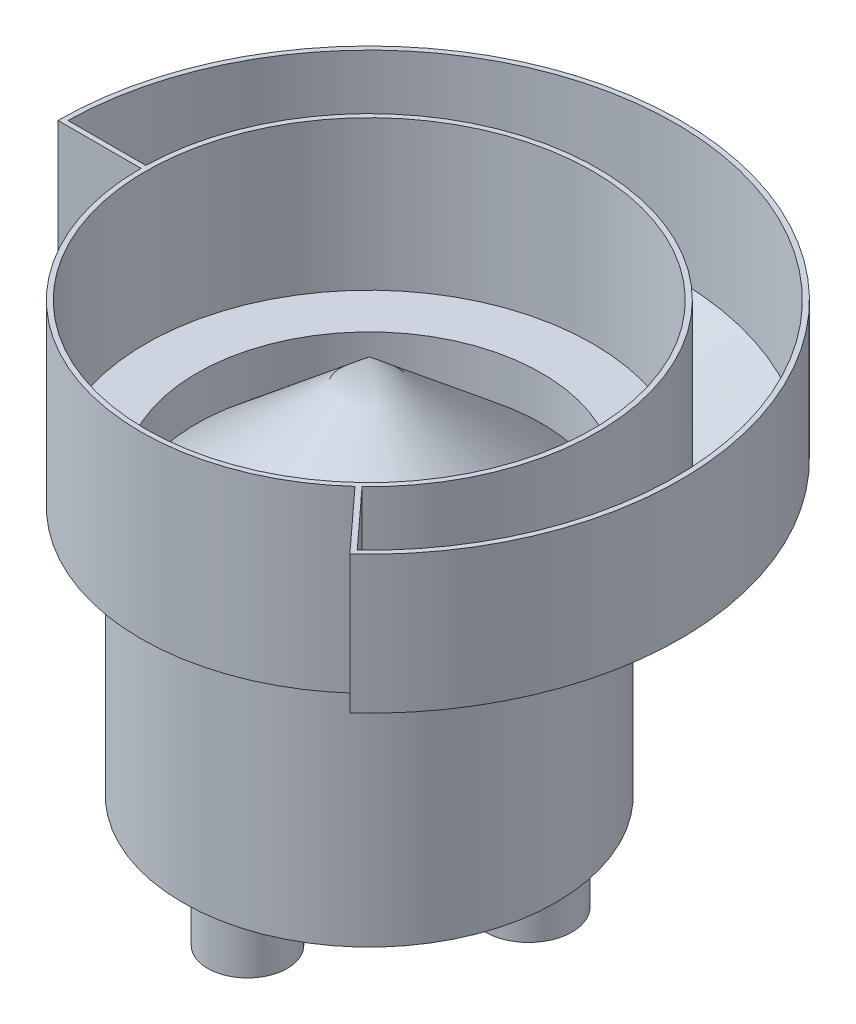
ISO-10303-21;
HEADER;
FILE_DESCRIPTION(('STEP AP214'),'2;1');
FILE_NAME('part.step','',(''),(''),'','','');
FILE_SCHEMA(('AUTOMOTIVE_DESIGN { 1 0 10303 214 1 1 1 1 }'));
ENDSEC;
DATA;
#1=APPLICATION_CONTEXT('core data for automotive mechanical design processes');
#2=APPLICATION_PROTOCOL_DEFINITION('international standard','automotive_design',2000,#1);
#3=PRODUCT_CONTEXT('',#1,'mechanical');
#4=PRODUCT('Part','Part','',(#3));
#5=PRODUCT_RELATED_PRODUCT_CATEGORY('part','',(#4));
#6=PRODUCT_DEFINITION_FORMATION('','',#4);
#7=PRODUCT_DEFINITION_CONTEXT('part definition',#1,'design');
#8=PRODUCT_DEFINITION('design','',#6,#7);
#9=PRODUCT_DEFINITION_SHAPE('','',#8);
#10=(LENGTH_UNIT() NAMED_UNIT(*) SI_UNIT(.MILLI.,.METRE.));
#11=(NAMED_UNIT(*) PLANE_ANGLE_UNIT() SI_UNIT($,.RADIAN.));
#12=(NAMED_UNIT(*) SI_UNIT($,.STERADIAN.) SOLID_ANGLE_UNIT());
#13=UNCERTAINTY_MEASURE_WITH_UNIT(LENGTH_MEASURE(1.E-05),#10,'distance_accuracy_value','');
#14=(GEOMETRIC_REPRESENTATION_CONTEXT(3) GLOBAL_UNCERTAINTY_ASSIGNED_CONTEXT((#13)) GLOBAL_UNIT_ASSIGNED_CONTEXT((#10,
#11,#12)) REPRESENTATION_CONTEXT('',''));
#15=CARTESIAN_POINT('',(0.,0.,0.));
#16=DIRECTION('',(0.,0.,1.));
#17=DIRECTION('',(1.,0.,0.));
#18=AXIS2_PLACEMENT_3D('',#15,#16,#17);
#19=CARTESIAN_POINT('',(-75.,0.,0.));
#20=DIRECTION('',(0.,1.,0.));
#21=DIRECTION('',(0.,0.,1.));
#22=AXIS2_PLACEMENT_3D('',#19,#20,#21);
#23=PLANE('',#22);
#24=CARTESIAN_POINT('',(0.,0.,48.8925632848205));
#25=DIRECTION('',(0.,-1.,0.));
#26=DIRECTION('',(0.,0.,-1.));
#27=AXIS2_PLACEMENT_3D('',#24,#25,#26);
#28=CIRCLE('',#27,15.9993430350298);
#29=CARTESIAN_POINT('',(0.,0.,32.8932202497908));
#30=VERTEX_POINT('',#29);
#31=EDGE_CURVE('E246',#30,#30,#28,.F.);
#32=ORIENTED_EDGE('',*,*,#31,.F.);
#33=EDGE_LOOP('',(#32));
#34=FACE_BOUND('',#33,.T.);
#35=ADVANCED_FACE('F18',(#34),#23,.F.);
#36=CARTESIAN_POINT('',(-75.,0.,0.));
#37=DIRECTION('',(0.,1.,0.));
#38=DIRECTION('',(0.,0.,1.));
#39=AXIS2_PLACEMENT_3D('',#36,#37,#38);
#40=PLANE('',#39);
#41=CARTESIAN_POINT('',(43.0724032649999,0.,-20.939056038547));
#42=DIRECTION('',(0.,-1.,0.));
#43=DIRECTION('',(0.,0.,-1.));
#44=AXIS2_PLACEMENT_3D('',#41,#42,#43);
#45=CIRCLE('',#44,17.4565692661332);
#46=CARTESIAN_POINT('',(43.0724032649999,0.,-38.3956253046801));
#47=VERTEX_POINT('',#46);
#48=EDGE_CURVE('E248',#47,#47,#45,.F.);
#49=ORIENTED_EDGE('',*,*,#48,.F.);
#50=EDGE_LOOP('',(#49));
#51=FACE_BOUND('',#50,.T.);
#52=ADVANCED_FACE('F457',(#51),#40,.F.);
#53=CARTESIAN_POINT('',(-75.,0.,0.));
#54=DIRECTION('',(0.,1.,0.));
#55=DIRECTION('',(0.,0.,1.));
#56=AXIS2_PLACEMENT_3D('',#53,#54,#55);
#57=PLANE('',#56);
#58=CARTESIAN_POINT('',(-39.1321335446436,0.,-26.2784302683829));
#59=DIRECTION('',(0.,-1.,0.));
#60=DIRECTION('',(0.,0.,-1.));
#61=AXIS2_PLACEMENT_3D('',#58,#59,#60);
#62=CIRCLE('',#61,18.0876713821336);
#63=CARTESIAN_POINT('',(-39.1321335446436,0.,-44.3661016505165));
#64=VERTEX_POINT('',#63);
#65=EDGE_CURVE('E254',#64,#64,#62,.F.);
#66=ORIENTED_EDGE('',*,*,#65,.F.);
#67=EDGE_LOOP('',(#66));
#68=FACE_BOUND('',#67,.T.);
#69=ADVANCED_FACE('F454',(#68),#57,.F.);
#70=CARTESIAN_POINT('',(0.,108.,0.));
#71=DIRECTION('',(0.,1.,0.));
#72=DIRECTION('',(0.,0.,1.));
#73=AXIS2_PLACEMENT_3D('',#70,#71,#72);
#74=PLANE('',#73);
#75=CARTESIAN_POINT('',(0.,108.,0.));
#76=DIRECTION('',(0.,1.,0.));
#77=DIRECTION('',(0.,0.,1.));
#78=AXIS2_PLACEMENT_3D('',#75,#76,#77);
#79=CIRCLE('',#78,71.2397935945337);
#80=CARTESIAN_POINT('',(0.,108.,71.2397935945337));
#81=VERTEX_POINT('',#80);
#82=EDGE_CURVE('E257',#81,#81,#79,.T.);
#83=ORIENTED_EDGE('',*,*,#82,.F.);
#84=EDGE_LOOP('',(#83));
#85=FACE_BOUND('',#84,.T.);
#86=ADVANCED_FACE('F450',(#85),#74,.F.);
#87=CARTESIAN_POINT('',(0.,32.,48.8925632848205));
#88=DIRECTION('',(0.,1.,0.));
#89=DIRECTION('',(0.,0.,1.));
#90=AXIS2_PLACEMENT_3D('',#87,#88,#89);
#91=PLANE('',#90);
#92=CARTESIAN_POINT('',(0.,32.,48.8925632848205));
#93=DIRECTION('',(0.,-1.,0.));
#94=DIRECTION('',(0.,0.,-1.));
#95=AXIS2_PLACEMENT_3D('',#92,#93,#94);
#96=CIRCLE('',#95,15.9993430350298);
#97=CARTESIAN_POINT('',(0.,32.,32.8932202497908));
#98=VERTEX_POINT('',#97);
#99=EDGE_CURVE('E260',#98,#98,#96,.T.);
#100=ORIENTED_EDGE('',*,*,#99,.F.);
#101=EDGE_LOOP('',(#100));
#102=FACE_BOUND('',#101,.T.);
#103=ADVANCED_FACE('F446',(#102),#91,.T.);
#104=CARTESIAN_POINT('',(43.0724032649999,32.,-20.939056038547));
#105=DIRECTION('',(0.,1.,0.));
#106=DIRECTION('',(0.,0.,1.));
#107=AXIS2_PLACEMENT_3D('',#104,#105,#106);
#108=PLANE('',#107);
#109=CARTESIAN_POINT('',(43.0724032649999,32.,-20.939056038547));
#110=DIRECTION('',(0.,-1.,0.));
#111=DIRECTION('',(0.,0.,-1.));
#112=AXIS2_PLACEMENT_3D('',#109,#110,#111);
#113=CIRCLE('',#112,17.4565692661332);
#114=CARTESIAN_POINT('',(43.0724032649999,32.,-38.3956253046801));
#115=VERTEX_POINT('',#114);
#116=EDGE_CURVE('E263',#115,#115,#113,.T.);
#117=ORIENTED_EDGE('',*,*,#116,.F.);
#118=EDGE_LOOP('',(#117));
#119=FACE_BOUND('',#118,.T.);
#120=ADVANCED_FACE('F442',(#119),#108,.T.);
#121=CARTESIAN_POINT('',(-39.1321335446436,32.,-26.2784302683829));
#122=DIRECTION('',(0.,1.,0.));
#123=DIRECTION('',(0.,0.,1.));
#124=AXIS2_PLACEMENT_3D('',#121,#122,#123);
#125=PLANE('',#124);
#126=CARTESIAN_POINT('',(-39.1321335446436,32.,-26.2784302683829));
#127=DIRECTION('',(0.,-1.,0.));
#128=DIRECTION('',(0.,0.,-1.));
#129=AXIS2_PLACEMENT_3D('',#126,#127,#128);
#130=CIRCLE('',#129,18.0876713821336);
#131=CARTESIAN_POINT('',(-39.1321335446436,32.,-44.3661016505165));
#132=VERTEX_POINT('',#131);
#133=EDGE_CURVE('E266',#132,#132,#130,.T.);
#134=ORIENTED_EDGE('',*,*,#133,.F.);
#135=EDGE_LOOP('',(#134));
#136=FACE_BOUND('',#135,.T.);
#137=ADVANCED_FACE('F438',(#136),#125,.T.);
#138=CARTESIAN_POINT('',(0.,30.,48.8925632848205));
#139=DIRECTION('',(0.,-1.,0.));
#140=DIRECTION('',(0.,0.,-1.));
#141=AXIS2_PLACEMENT_3D('',#138,#139,#140);
#142=CYLINDRICAL_SURFACE('',#141,15.9993430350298);
#143=CARTESIAN_POINT('',(0.,28.,48.8925632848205));
#144=DIRECTION('',(0.,-1.,0.));
#145=DIRECTION('',(0.,0.,-1.));
#146=AXIS2_PLACEMENT_3D('',#143,#144,#145);
#147=CIRCLE('',#146,15.9993430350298);
#148=CARTESIAN_POINT('',(0.,28.,32.8932202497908));
#149=VERTEX_POINT('',#148);
#150=EDGE_CURVE('E269',#149,#149,#147,.F.);
#151=ORIENTED_EDGE('',*,*,#150,.F.);
#152=EDGE_LOOP('',(#151));
#153=FACE_BOUND('',#152,.T.);
#154=ORIENTED_EDGE('',*,*,#31,.T.);
#155=EDGE_LOOP('',(#154));
#156=FACE_BOUND('',#155,.T.);
#157=ADVANCED_FACE('F434',(#153,#156),#142,.T.);
#158=CARTESIAN_POINT('',(43.0724032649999,30.,-20.939056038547));
#159=DIRECTION('',(0.,-1.,0.));
#160=DIRECTION('',(0.,0.,-1.));
#161=AXIS2_PLACEMENT_3D('',#158,#159,#160);
#162=CYLINDRICAL_SURFACE('',#161,17.4565692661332);
#163=CARTESIAN_POINT('',(43.0724032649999,28.,-20.939056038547));
#164=DIRECTION('',(0.,-1.,0.));
#165=DIRECTION('',(0.,0.,-1.));
#166=AXIS2_PLACEMENT_3D('',#163,#164,#165);
#167=CIRCLE('',#166,17.4565692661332);
#168=CARTESIAN_POINT('',(43.0724032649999,28.,-38.3956253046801));
#169=VERTEX_POINT('',#168);
#170=EDGE_CURVE('E272',#169,#169,#167,.F.);
#171=ORIENTED_EDGE('',*,*,#170,.F.);
#172=EDGE_LOOP('',(#171));
#173=FACE_BOUND('',#172,.T.);
#174=ORIENTED_EDGE('',*,*,#48,.T.);
#175=EDGE_LOOP('',(#174));
#176=FACE_BOUND('',#175,.T.);
#177=ADVANCED_FACE('F430',(#173,#176),#162,.T.);
#178=CARTESIAN_POINT('',(-39.1321335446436,30.,-26.2784302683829));
#179=DIRECTION('',(0.,-1.,0.));
#180=DIRECTION('',(0.,0.,-1.));
#181=AXIS2_PLACEMENT_3D('',#178,#179,#180);
#182=CYLINDRICAL_SURFACE('',#181,18.0876713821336);
#183=CARTESIAN_POINT('',(-39.1321335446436,28.,-26.2784302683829));
#184=DIRECTION('',(0.,-1.,0.));
#185=DIRECTION('',(0.,0.,-1.));
#186=AXIS2_PLACEMENT_3D('',#183,#184,#185);
#187=CIRCLE('',#186,18.0876713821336);
#188=CARTESIAN_POINT('',(-39.1321335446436,28.,-44.3661016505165));
#189=VERTEX_POINT('',#188);
#190=EDGE_CURVE('E275',#189,#189,#187,.F.);
#191=ORIENTED_EDGE('',*,*,#190,.F.);
#192=EDGE_LOOP('',(#191));
#193=FACE_BOUND('',#192,.T.);
#194=ORIENTED_EDGE('',*,*,#65,.T.);
#195=EDGE_LOOP('',(#194));
#196=FACE_BOUND('',#195,.T.);
#197=ADVANCED_FACE('F426',(#193,#196),#182,.T.);
#198=CARTESIAN_POINT('',(0.,110.,0.));
#199=DIRECTION('',(0.,1.,0.));
#200=DIRECTION('',(0.,0.,1.));
#201=AXIS2_PLACEMENT_3D('',#198,#199,#200);
#202=CYLINDRICAL_SURFACE('',#201,71.2397935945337);
#203=ORIENTED_EDGE('',*,*,#82,.T.);
#204=EDGE_LOOP('',(#203));
#205=FACE_BOUND('',#204,.T.);
#206=CARTESIAN_POINT('',(0.,119.741106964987,0.));
#207=DIRECTION('',(0.,1.,0.));
#208=DIRECTION('',(0.,0.,1.));
#209=AXIS2_PLACEMENT_3D('',#206,#207,#208);
#210=CIRCLE('',#209,71.2397935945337);
#211=CARTESIAN_POINT('',(0.,119.741106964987,71.2397935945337));
#212=VERTEX_POINT('',#211);
#213=EDGE_CURVE('E278',#212,#212,#210,.T.);
#214=ORIENTED_EDGE('',*,*,#213,.F.);
#215=EDGE_LOOP('',(#214));
#216=FACE_BOUND('',#215,.T.);
#217=ADVANCED_FACE('F422',(#205,#216),#202,.T.);
#218=CARTESIAN_POINT('',(0.,30.,48.8925632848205));
#219=DIRECTION('',(0.,-1.,0.));
#220=DIRECTION('',(0.,0.,-1.));
#221=AXIS2_PLACEMENT_3D('',#218,#219,#220);
#222=CYLINDRICAL_SURFACE('',#221,15.9993430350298);
#223=CARTESIAN_POINT('',(0.,30.,48.8925632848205));
#224=DIRECTION('',(0.,-1.,0.));
#225=DIRECTION('',(0.,0.,-1.));
#226=AXIS2_PLACEMENT_3D('',#223,#224,#225);
#227=CIRCLE('',#226,15.9993430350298);
#228=CARTESIAN_POINT('',(0.,30.,32.8932202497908));
#229=VERTEX_POINT('',#228);
#230=EDGE_CURVE('E281',#229,#229,#227,.F.);
#231=ORIENTED_EDGE('',*,*,#230,.T.);
#232=EDGE_LOOP('',(#231));
#233=FACE_BOUND('',#232,.T.);
#234=ORIENTED_EDGE('',*,*,#99,.T.);
#235=EDGE_LOOP('',(#234));
#236=FACE_BOUND('',#235,.T.);
#237=ADVANCED_FACE('F418',(#233,#236),#222,.T.);
#238=CARTESIAN_POINT('',(43.0724032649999,30.,-20.939056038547));
#239=DIRECTION('',(0.,-1.,0.));
#240=DIRECTION('',(0.,0.,-1.));
#241=AXIS2_PLACEMENT_3D('',#238,#239,#240);
#242=CYLINDRICAL_SURFACE('',#241,17.4565692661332);
#243=CARTESIAN_POINT('',(43.0724032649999,30.,-20.939056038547));
#244=DIRECTION('',(0.,-1.,0.));
#245=DIRECTION('',(0.,0.,-1.));
#246=AXIS2_PLACEMENT_3D('',#243,#244,#245);
#247=CIRCLE('',#246,17.4565692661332);
#248=CARTESIAN_POINT('',(43.0724032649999,30.,-38.3956253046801));
#249=VERTEX_POINT('',#248);
#250=EDGE_CURVE('E125',#249,#249,#247,.F.);
#251=ORIENTED_EDGE('',*,*,#250,.T.);
#252=EDGE_LOOP('',(#251));
#253=FACE_BOUND('',#252,.T.);
#254=ORIENTED_EDGE('',*,*,#116,.T.);
#255=EDGE_LOOP('',(#254));
#256=FACE_BOUND('',#255,.T.);
#257=ADVANCED_FACE('F414',(#253,#256),#242,.T.);
#258=CARTESIAN_POINT('',(-39.1321335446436,30.,-26.2784302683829));
#259=DIRECTION('',(0.,-1.,0.));
#260=DIRECTION('',(0.,0.,-1.));
#261=AXIS2_PLACEMENT_3D('',#258,#259,#260);
#262=CYLINDRICAL_SURFACE('',#261,18.0876713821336);
#263=CARTESIAN_POINT('',(-39.1321335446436,30.,-26.2784302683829));
#264=DIRECTION('',(0.,-1.,0.));
#265=DIRECTION('',(0.,0.,-1.));
#266=AXIS2_PLACEMENT_3D('',#263,#264,#265);
#267=CIRCLE('',#266,18.0876713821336);
#268=CARTESIAN_POINT('',(-39.1321335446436,30.,-44.3661016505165));
#269=VERTEX_POINT('',#268);
#270=EDGE_CURVE('E119',#269,#269,#267,.F.);
#271=ORIENTED_EDGE('',*,*,#270,.T.);
#272=EDGE_LOOP('',(#271));
#273=FACE_BOUND('',#272,.T.);
#274=ORIENTED_EDGE('',*,*,#133,.T.);
#275=EDGE_LOOP('',(#274));
#276=FACE_BOUND('',#275,.T.);
#277=ADVANCED_FACE('F112',(#273,#276),#262,.T.);
#278=CARTESIAN_POINT('',(0.,122.511149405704,0.));
#279=DIRECTION('',(0.,-1.,0.));
#280=DIRECTION('',(1.,0.,0.));
#281=AXIS2_PLACEMENT_3D('',#278,#279,#280);
#282=CONICAL_SURFACE('',#281,69.2397935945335,0.875385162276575);
#283=CARTESIAN_POINT('',(0.,180.289966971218,2.22044604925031E-13));
#284=VERTEX_POINT('',#283);
#285=VERTEX_LOOP('',#284);
#286=FACE_BOUND('',#285,.T.);
#287=CARTESIAN_POINT('',(0.,122.511149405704,0.));
#288=DIRECTION('',(0.,1.,0.));
#289=DIRECTION('',(0.,0.,1.));
#290=AXIS2_PLACEMENT_3D('',#287,#288,#289);
#291=CIRCLE('',#290,69.2397935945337);
#292=CARTESIAN_POINT('',(0.,122.511149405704,69.2397935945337));
#293=VERTEX_POINT('',#292);
#294=EDGE_CURVE('E116',#293,#293,#291,.T.);
#295=ORIENTED_EDGE('',*,*,#294,.T.);
#296=EDGE_LOOP('',(#295));
#297=FACE_BOUND('',#296,.T.);
#298=ADVANCED_FACE('F108',(#286,#297),#282,.T.);
#299=CARTESIAN_POINT('',(0.,28.,0.));
#300=DIRECTION('',(0.,-1.,0.));
#301=DIRECTION('',(0.,0.,-1.));
#302=AXIS2_PLACEMENT_3D('',#299,#300,#301);
#303=PLANE('',#302);
#304=CARTESIAN_POINT('',(0.,28.,0.));
#305=DIRECTION('',(0.,-1.,0.));
#306=DIRECTION('',(0.,0.,-1.));
#307=AXIS2_PLACEMENT_3D('',#304,#305,#306);
#308=CIRCLE('',#307,75.);
#309=CARTESIAN_POINT('',(0.,28.,-75.));
#310=VERTEX_POINT('',#309);
#311=EDGE_CURVE('E118',#310,#310,#308,.F.);
#312=ORIENTED_EDGE('',*,*,#311,.F.);
#313=EDGE_LOOP('',(#312));
#314=FACE_BOUND('',#313,.T.);
#315=ORIENTED_EDGE('',*,*,#190,.T.);
#316=EDGE_LOOP('',(#315));
#317=FACE_BOUND('',#316,.T.);
#318=ORIENTED_EDGE('',*,*,#170,.T.);
#319=EDGE_LOOP('',(#318));
#320=FACE_BOUND('',#319,.T.);
#321=ORIENTED_EDGE('',*,*,#150,.T.);
#322=EDGE_LOOP('',(#321));
#323=FACE_BOUND('',#322,.T.);
#324=ADVANCED_FACE('F111',(#314,#317,#320,#323),#303,.T.);
#325=CARTESIAN_POINT('',(0.,119.741106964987,0.));
#326=DIRECTION('',(0.,-1.,0.));
#327=DIRECTION('',(0.,0.,-1.));
#328=AXIS2_PLACEMENT_3D('',#325,#326,#327);
#329=PLANE('',#328);
#330=CARTESIAN_POINT('',(0.,119.741106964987,0.));
#331=DIRECTION('',(0.,-1.,0.));
#332=DIRECTION('',(1.,0.,0.));
#333=AXIS2_PLACEMENT_3D('',#330,#331,#332);
#334=CIRCLE('',#333,72.5593002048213);
#335=CARTESIAN_POINT('',(72.5593002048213,119.741106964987,0.));
#336=VERTEX_POINT('',#335);
#337=EDGE_CURVE('E122',#336,#336,#334,.F.);
#338=ORIENTED_EDGE('',*,*,#337,.F.);
#339=EDGE_LOOP('',(#338));
#340=FACE_BOUND('',#339,.T.);
#341=ORIENTED_EDGE('',*,*,#213,.T.);
#342=EDGE_LOOP('',(#341));
#343=FACE_BOUND('',#342,.T.);
#344=ADVANCED_FACE('F404',(#340,#343),#329,.T.);
#345=CARTESIAN_POINT('',(0.,30.,0.));
#346=DIRECTION('',(0.,-1.,0.));
#347=DIRECTION('',(0.,0.,-1.));
#348=AXIS2_PLACEMENT_3D('',#345,#346,#347);
#349=PLANE('',#348);
#350=CARTESIAN_POINT('',(0.,30.,0.));
#351=DIRECTION('',(0.,-1.,0.));
#352=DIRECTION('',(0.,0.,-1.));
#353=AXIS2_PLACEMENT_3D('',#350,#351,#352);
#354=CIRCLE('',#353,73.);
#355=CARTESIAN_POINT('',(0.,30.,-73.));
#356=VERTEX_POINT('',#355);
#357=EDGE_CURVE('E288',#356,#356,#354,.F.);
#358=ORIENTED_EDGE('',*,*,#357,.T.);
#359=EDGE_LOOP('',(#358));
#360=FACE_BOUND('',#359,.T.);
#361=ORIENTED_EDGE('',*,*,#270,.F.);
#362=EDGE_LOOP('',(#361));
#363=FACE_BOUND('',#362,.T.);
#364=ORIENTED_EDGE('',*,*,#250,.F.);
#365=EDGE_LOOP('',(#364));
#366=FACE_BOUND('',#365,.T.);
#367=ORIENTED_EDGE('',*,*,#230,.F.);
#368=EDGE_LOOP('',(#367));
#369=FACE_BOUND('',#368,.T.);
#370=ADVANCED_FACE('F400',(#360,#363,#366,#369),#349,.F.);
#371=CARTESIAN_POINT('',(0.,110.,0.));
#372=DIRECTION('',(0.,1.,0.));
#373=DIRECTION('',(0.,0.,1.));
#374=AXIS2_PLACEMENT_3D('',#371,#372,#373);
#375=CYLINDRICAL_SURFACE('',#374,69.2397935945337);
#376=CARTESIAN_POINT('',(0.,140.,0.));
#377=DIRECTION('',(0.,1.,0.));
#378=DIRECTION('',(0.,0.,1.));
#379=AXIS2_PLACEMENT_3D('',#376,#377,#378);
#380=CIRCLE('',#379,69.2397935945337);
#381=CARTESIAN_POINT('',(0.,140.,69.2397935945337));
#382=VERTEX_POINT('',#381);
#383=EDGE_CURVE('E290',#382,#382,#380,.F.);
#384=ORIENTED_EDGE('',*,*,#383,.F.);
#385=EDGE_LOOP('',(#384));
#386=FACE_BOUND('',#385,.T.);
#387=ORIENTED_EDGE('',*,*,#294,.F.);
#388=EDGE_LOOP('',(#387));
#389=FACE_BOUND('',#388,.T.);
#390=ADVANCED_FACE('F396',(#386,#389),#375,.F.);
#391=CARTESIAN_POINT('',(0.,0.,0.));
#392=DIRECTION('',(0.,-1.,0.));
#393=DIRECTION('',(0.,0.,-1.));
#394=AXIS2_PLACEMENT_3D('',#391,#392,#393);
#395=CYLINDRICAL_SURFACE('',#394,75.);
#396=CARTESIAN_POINT('',(0.,119.741106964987,0.));
#397=DIRECTION('',(0.,1.,0.));
#398=DIRECTION('',(0.,0.,1.));
#399=AXIS2_PLACEMENT_3D('',#396,#397,#398);
#400=CIRCLE('',#399,75.);
#401=CARTESIAN_POINT('',(0.,119.741106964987,75.));
#402=VERTEX_POINT('',#401);
#403=EDGE_CURVE('E128',#402,#402,#400,.T.);
#404=ORIENTED_EDGE('',*,*,#403,.F.);
#405=EDGE_LOOP('',(#404));
#406=FACE_BOUND('',#405,.T.);
#407=ORIENTED_EDGE('',*,*,#311,.T.);
#408=EDGE_LOOP('',(#407));
#409=FACE_BOUND('',#408,.T.);
#410=ADVANCED_FACE('F392',(#406,#409),#395,.T.);
#411=CARTESIAN_POINT('',(0.,119.741106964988,0.));
#412=DIRECTION('',(0.,-1.,0.));
#413=DIRECTION('',(1.,0.,0.));
#414=AXIS2_PLACEMENT_3D('',#411,#412,#413);
#415=CONICAL_SURFACE('',#414,72.559300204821,0.8753851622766);
#416=ORIENTED_EDGE('',*,*,#337,.T.);
#417=EDGE_LOOP('',(#416));
#418=FACE_BOUND('',#417,.T.);
#419=CARTESIAN_POINT('',(0.,120.842201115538,0.));
#420=DIRECTION('',(0.,1.,0.));
#421=DIRECTION('',(0.,0.,1.));
#422=AXIS2_PLACEMENT_3D('',#419,#420,#421);
#423=CIRCLE('',#422,71.2397935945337);
#424=CARTESIAN_POINT('',(0.,120.842201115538,71.2397935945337));
#425=VERTEX_POINT('',#424);
#426=EDGE_CURVE('E295',#425,#425,#423,.T.);
#427=ORIENTED_EDGE('',*,*,#426,.F.);
#428=EDGE_LOOP('',(#427));
#429=FACE_BOUND('',#428,.T.);
#430=ADVANCED_FACE('F388',(#418,#429),#415,.T.);
#431=CARTESIAN_POINT('',(0.,0.,0.));
#432=DIRECTION('',(0.,-1.,0.));
#433=DIRECTION('',(0.,0.,-1.));
#434=AXIS2_PLACEMENT_3D('',#431,#432,#433);
#435=CYLINDRICAL_SURFACE('',#434,73.);
#436=ORIENTED_EDGE('',*,*,#357,.F.);
#437=EDGE_LOOP('',(#436));
#438=FACE_BOUND('',#437,.T.);
#439=CARTESIAN_POINT('',(0.,120.977777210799,0.));
#440=DIRECTION('',(0.,1.,0.));
#441=DIRECTION('',(0.,0.,1.));
#442=AXIS2_PLACEMENT_3D('',#439,#440,#441);
#443=CIRCLE('',#442,73.);
#444=CARTESIAN_POINT('',(0.,120.977777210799,73.));
#445=VERTEX_POINT('',#444);
#446=EDGE_CURVE('E302',#445,#445,#443,.T.);
#447=ORIENTED_EDGE('',*,*,#446,.T.);
#448=EDGE_LOOP('',(#447));
#449=FACE_BOUND('',#448,.T.);
#450=ADVANCED_FACE('F382',(#438,#449),#435,.F.);
#451=CARTESIAN_POINT('',(0.,140.,0.));
#452=DIRECTION('',(0.,1.,0.));
#453=DIRECTION('',(0.,0.,1.));
#454=AXIS2_PLACEMENT_3D('',#451,#452,#453);
#455=PLANE('',#454);
#456=CARTESIAN_POINT('',(0.,140.,0.));
#457=DIRECTION('',(0.,1.,0.));
#458=DIRECTION('',(0.,0.,1.));
#459=AXIS2_PLACEMENT_3D('',#456,#457,#458);
#460=CIRCLE('',#459,89.7500101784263);
#461=CARTESIAN_POINT('',(0.,140.,89.7500101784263));
#462=VERTEX_POINT('',#461);
#463=EDGE_CURVE('E185',#462,#462,#460,.T.);
#464=ORIENTED_EDGE('',*,*,#463,.T.);
#465=EDGE_LOOP('',(#464));
#466=FACE_BOUND('',#465,.T.);
#467=ORIENTED_EDGE('',*,*,#383,.T.);
#468=EDGE_LOOP('',(#467));
#469=FACE_BOUND('',#468,.T.);
#470=ADVANCED_FACE('F375',(#466,#469),#455,.T.);
#471=CARTESIAN_POINT('',(0.,144.713878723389,0.));
#472=DIRECTION('',(0.,1.,0.));
#473=DIRECTION('',(0.,0.,1.));
#474=AXIS2_PLACEMENT_3D('',#471,#472,#473);
#475=CONICAL_SURFACE('',#474,125.,1.10758446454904);
#476=ORIENTED_EDGE('',*,*,#403,.T.);
#477=EDGE_LOOP('',(#476));
#478=FACE_BOUND('',#477,.T.);
#479=DIRECTION('',(-0.894621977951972,0.446823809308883,0.));
#480=VECTOR('',#479,1.);
#481=CARTESIAN_POINT('',(-91.6924033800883,128.07821855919,0.));
#482=LINE('',#481,#480);
#483=CARTESIAN_POINT('',(-91.6924033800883,128.07821855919,0.));
#484=VERTEX_POINT('',#483);
#485=CARTESIAN_POINT('',(-125.,144.713878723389,0.));
#486=VERTEX_POINT('',#485);
#487=EDGE_CURVE('E95',#484,#486,#482,.T.);
#488=ORIENTED_EDGE('',*,*,#487,.T.);
#489=CARTESIAN_POINT('',(0.,144.713878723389,0.));
#490=DIRECTION('',(0.,-1.,0.));
#491=DIRECTION('',(0.,0.,-1.));
#492=AXIS2_PLACEMENT_3D('',#489,#490,#491);
#493=CIRCLE('',#492,125.);
#494=CARTESIAN_POINT('',(84.4091450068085,144.713878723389,92.1959665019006));
#495=VERTEX_POINT('',#494);
#496=EDGE_CURVE('E104',#495,#486,#493,.F.);
#497=ORIENTED_EDGE('',*,*,#496,.F.);
#498=DIRECTION('',(-0.604114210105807,-0.446823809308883,-0.659844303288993));
#499=VECTOR('',#498,1.);
#500=CARTESIAN_POINT('',(84.4091450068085,144.713878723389,92.1959665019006));
#501=LINE('',#500,#499);
#502=CARTESIAN_POINT('',(61.9174189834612,128.07821855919,67.6293580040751));
#503=VERTEX_POINT('',#502);
#504=EDGE_CURVE('E309',#495,#503,#501,.T.);
#505=ORIENTED_EDGE('',*,*,#504,.T.);
#506=CARTESIAN_POINT('',(0.,128.07821855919,0.));
#507=DIRECTION('',(0.,1.,0.));
#508=DIRECTION('',(0.,0.,1.));
#509=AXIS2_PLACEMENT_3D('',#506,#507,#508);
#510=CIRCLE('',#509,91.6924033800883);
#511=EDGE_CURVE('E314',#484,#503,#510,.T.);
#512=ORIENTED_EDGE('',*,*,#511,.F.);
#513=EDGE_LOOP('',(#488,#497,#505,#512));
#514=FACE_BOUND('',#513,.T.);
#515=ADVANCED_FACE('F372',(#478,#514),#475,.T.);
#516=CARTESIAN_POINT('',(0.,110.,0.));
#517=DIRECTION('',(0.,1.,0.));
#518=DIRECTION('',(0.,0.,1.));
#519=AXIS2_PLACEMENT_3D('',#516,#517,#518);
#520=CYLINDRICAL_SURFACE('',#519,71.2397935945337);
#521=CARTESIAN_POINT('',(0.,138.,0.));
#522=DIRECTION('',(0.,1.,0.));
#523=DIRECTION('',(0.,0.,1.));
#524=AXIS2_PLACEMENT_3D('',#521,#522,#523);
#525=CIRCLE('',#524,71.2397935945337);
#526=CARTESIAN_POINT('',(0.,138.,71.2397935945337));
#527=VERTEX_POINT('',#526);
#528=EDGE_CURVE('E157',#527,#527,#525,.F.);
#529=ORIENTED_EDGE('',*,*,#528,.T.);
#530=EDGE_LOOP('',(#529));
#531=FACE_BOUND('',#530,.T.);
#532=ORIENTED_EDGE('',*,*,#426,.T.);
#533=EDGE_LOOP('',(#532));
#534=FACE_BOUND('',#533,.T.);
#535=ADVANCED_FACE('F374',(#531,#534),#520,.T.);
#536=CARTESIAN_POINT('',(0.,0.,0.));
#537=DIRECTION('',(0.,1.,0.));
#538=DIRECTION('',(0.,0.,1.));
#539=AXIS2_PLACEMENT_3D('',#536,#537,#538);
#540=CYLINDRICAL_SURFACE('',#539,89.6924033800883);
#541=CARTESIAN_POINT('',(0.,129.314888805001,0.));
#542=DIRECTION('',(0.,1.,0.));
#543=DIRECTION('',(0.,0.,1.));
#544=AXIS2_PLACEMENT_3D('',#541,#542,#543);
#545=CIRCLE('',#544,89.6924033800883);
#546=CARTESIAN_POINT('',(62.0269487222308,129.314888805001,64.7872275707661));
#547=VERTEX_POINT('',#546);
#548=CARTESIAN_POINT('',(-89.6701021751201,129.314888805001,-2.));
#549=VERTEX_POINT('',#548);
#550=EDGE_CURVE('E299',#547,#549,#545,.F.);
#551=ORIENTED_EDGE('',*,*,#550,.T.);
#552=DIRECTION('',(0.,1.,0.));
#553=VECTOR('',#552,1.);
#554=CARTESIAN_POINT('',(-89.6701021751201,0.,-2.));
#555=LINE('',#554,#553);
#556=CARTESIAN_POINT('',(-89.6701021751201,138.,-2.));
#557=VERTEX_POINT('',#556);
#558=EDGE_CURVE('E156',#557,#549,#555,.F.);
#559=ORIENTED_EDGE('',*,*,#558,.F.);
#560=CARTESIAN_POINT('',(0.,138.,0.));
#561=DIRECTION('',(0.,1.,0.));
#562=DIRECTION('',(0.,0.,1.));
#563=AXIS2_PLACEMENT_3D('',#560,#561,#562);
#564=CIRCLE('',#563,89.6924033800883);
#565=CARTESIAN_POINT('',(62.0269487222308,138.,64.7872275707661));
#566=VERTEX_POINT('',#565);
#567=EDGE_CURVE('E184',#557,#566,#564,.T.);
#568=ORIENTED_EDGE('',*,*,#567,.T.);
#569=DIRECTION('',(0.,1.,0.));
#570=VECTOR('',#569,1.);
#571=CARTESIAN_POINT('',(62.0269487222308,0.,64.7872275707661));
#572=LINE('',#571,#570);
#573=EDGE_CURVE('E182',#547,#566,#572,.T.);
#574=ORIENTED_EDGE('',*,*,#573,.F.);
#575=EDGE_LOOP('',(#551,#559,#568,#574));
#576=FACE_BOUND('',#575,.T.);
#577=ADVANCED_FACE('F169',(#576),#540,.F.);
#578=CARTESIAN_POINT('',(0.,145.9505489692,0.));
#579=DIRECTION('',(0.,1.,0.));
#580=DIRECTION('',(0.,0.,1.));
#581=AXIS2_PLACEMENT_3D('',#578,#579,#580);
#582=CONICAL_SURFACE('',#581,123.,1.10758446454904);
#583=ORIENTED_EDGE('',*,*,#550,.F.);
#584=CARTESIAN_POINT('',(84.5227533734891,145.9505489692,89.3582909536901));
#585=CARTESIAN_POINT('',(80.7734951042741,143.177812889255,85.2631601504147));
#586=CARTESIAN_POINT('',(77.0242155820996,140.405139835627,81.1680061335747));
#587=CARTESIAN_POINT('',(69.5256140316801,134.859919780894,72.9776516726));
#588=CARTESIAN_POINT('',(65.7762920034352,132.087372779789,68.8824512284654));
#589=CARTESIAN_POINT('',(62.0269487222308,129.314888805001,64.7872275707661));
#590=B_SPLINE_CURVE_WITH_KNOTS('',3,(#584,#585,#586,#587,#588,#589),.UNSPECIFIED.,.F.,.F.,(4,2,
4),(0.,18.6181603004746,37.2363206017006),.UNSPECIFIED.);
#591=CARTESIAN_POINT('',(84.5227533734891,145.9505489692,89.3582909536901));
#592=VERTEX_POINT('',#591);
#593=EDGE_CURVE('E175',#592,#547,#590,.T.);
#594=ORIENTED_EDGE('',*,*,#593,.F.);
#595=CARTESIAN_POINT('',(0.,145.9505489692,0.));
#596=DIRECTION('',(0.,-1.,0.));
#597=DIRECTION('',(0.,0.,-1.));
#598=AXIS2_PLACEMENT_3D('',#595,#596,#597);
#599=CIRCLE('',#598,123.);
#600=CARTESIAN_POINT('',(-122.983738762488,145.9505489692,-2.));
#601=VERTEX_POINT('',#600);
#602=EDGE_CURVE('E85',#592,#601,#599,.F.);
#603=ORIENTED_EDGE('',*,*,#602,.T.);
#604=CARTESIAN_POINT('',(-89.6701021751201,129.314888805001,-2.));
#605=CARTESIAN_POINT('',(-95.2224378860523,132.087372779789,-2.));
#606=CARTESIAN_POINT('',(-100.774742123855,134.859919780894,-2.));
#607=CARTESIAN_POINT('',(-111.879287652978,140.405139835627,-2.));
#608=CARTESIAN_POINT('',(-117.431528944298,143.177812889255,-2.));
#609=CARTESIAN_POINT('',(-122.983738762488,145.9505489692,-2.));
#610=B_SPLINE_CURVE_WITH_KNOTS('',3,(#604,#605,#606,#607,#608,#609),.UNSPECIFIED.,.F.,.F.,(4,2,
4),(0.,18.618160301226,37.2363206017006),.UNSPECIFIED.);
#611=EDGE_CURVE('E147',#549,#601,#610,.T.);
#612=ORIENTED_EDGE('',*,*,#611,.F.);
#613=EDGE_LOOP('',(#583,#594,#603,#612));
#614=FACE_BOUND('',#613,.T.);
#615=ORIENTED_EDGE('',*,*,#446,.F.);
#616=EDGE_LOOP('',(#615));
#617=FACE_BOUND('',#616,.T.);
#618=ADVANCED_FACE('F163',(#614,#617),#582,.F.);
#619=CARTESIAN_POINT('',(0.,0.,0.));
#620=DIRECTION('',(0.,-1.,0.));
#621=DIRECTION('',(0.,0.,-1.));
#622=AXIS2_PLACEMENT_3D('',#619,#620,#621);
#623=CYLINDRICAL_SURFACE('',#622,123.);
#624=CARTESIAN_POINT('',(0.,200.,0.));
#625=DIRECTION('',(0.,-1.,0.));
#626=DIRECTION('',(0.,0.,-1.));
#627=AXIS2_PLACEMENT_3D('',#624,#625,#626);
#628=CIRCLE('',#627,123.);
#629=CARTESIAN_POINT('',(84.5227533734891,200.,89.3582909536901));
#630=VERTEX_POINT('',#629);
#631=CARTESIAN_POINT('',(-122.983738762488,200.,-2.));
#632=VERTEX_POINT('',#631);
#633=EDGE_CURVE('E144',#630,#632,#628,.F.);
#634=ORIENTED_EDGE('',*,*,#633,.T.);
#635=DIRECTION('',(0.,1.,0.));
#636=VECTOR('',#635,1.);
#637=CARTESIAN_POINT('',(-122.983738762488,0.,-2.));
#638=LINE('',#637,#636);
#639=EDGE_CURVE('E155',#601,#632,#638,.T.);
#640=ORIENTED_EDGE('',*,*,#639,.F.);
#641=ORIENTED_EDGE('',*,*,#602,.F.);
#642=DIRECTION('',(0.,1.,0.));
#643=VECTOR('',#642,1.);
#644=CARTESIAN_POINT('',(84.5227533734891,0.,89.3582909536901));
#645=LINE('',#644,#643);
#646=EDGE_CURVE('E183',#630,#592,#645,.F.);
#647=ORIENTED_EDGE('',*,*,#646,.F.);
#648=EDGE_LOOP('',(#634,#640,#641,#647));
#649=FACE_BOUND('',#648,.T.);
#650=ADVANCED_FACE('F168',(#649),#623,.F.);
#651=CARTESIAN_POINT('',(0.,140.,0.));
#652=DIRECTION('',(0.,1.,0.));
#653=DIRECTION('',(0.,0.,1.));
#654=AXIS2_PLACEMENT_3D('',#651,#652,#653);
#655=CYLINDRICAL_SURFACE('',#654,89.7500101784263);
#656=ORIENTED_EDGE('',*,*,#463,.F.);
#657=EDGE_LOOP('',(#656));
#658=FACE_BOUND('',#657,.T.);
#659=CARTESIAN_POINT('',(0.,200.,0.));
#660=DIRECTION('',(0.,1.,0.));
#661=DIRECTION('',(0.,0.,1.));
#662=AXIS2_PLACEMENT_3D('',#659,#660,#661);
#663=CIRCLE('',#662,89.7500101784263);
#664=CARTESIAN_POINT('',(0.,200.,89.7500101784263));
#665=VERTEX_POINT('',#664);
#666=EDGE_CURVE('E141',#665,#665,#663,.T.);
#667=ORIENTED_EDGE('',*,*,#666,.T.);
#668=EDGE_LOOP('',(#667));
#669=FACE_BOUND('',#668,.T.);
#670=ADVANCED_FACE('F207',(#658,#669),#655,.F.);
#671=CARTESIAN_POINT('',(61.9174189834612,0.,67.6293580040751));
#672=DIRECTION('',(0.737567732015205,0.,-0.675273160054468));
#673=DIRECTION('',(-0.675273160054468,0.,-0.737567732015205));
#674=AXIS2_PLACEMENT_3D('',#671,#672,#673);
#675=PLANE('',#674);
#676=DIRECTION('',(-0.675273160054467,0.,-0.737567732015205));
#677=VECTOR('',#676,1.);
#678=CARTESIAN_POINT('',(84.4091450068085,200.,92.1959665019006));
#679=LINE('',#678,#677);
#680=CARTESIAN_POINT('',(84.4091450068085,200.,92.1959665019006));
#681=VERTEX_POINT('',#680);
#682=CARTESIAN_POINT('',(61.9174189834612,200.,67.6293580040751));
#683=VERTEX_POINT('',#682);
#684=EDGE_CURVE('E140',#681,#683,#679,.T.);
#685=ORIENTED_EDGE('',*,*,#684,.T.);
#686=DIRECTION('',(0.,1.,0.));
#687=VECTOR('',#686,1.);
#688=CARTESIAN_POINT('',(61.9174189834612,0.,67.6293580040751));
#689=LINE('',#688,#687);
#690=EDGE_CURVE('E316',#503,#683,#689,.T.);
#691=ORIENTED_EDGE('',*,*,#690,.F.);
#692=ORIENTED_EDGE('',*,*,#504,.F.);
#693=DIRECTION('',(0.,1.,0.));
#694=VECTOR('',#693,1.);
#695=CARTESIAN_POINT('',(84.4091450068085,0.,92.1959665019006));
#696=LINE('',#695,#694);
#697=EDGE_CURVE('E311',#681,#495,#696,.F.);
#698=ORIENTED_EDGE('',*,*,#697,.F.);
#699=EDGE_LOOP('',(#685,#691,#692,#698));
#700=FACE_BOUND('',#699,.T.);
#701=ADVANCED_FACE('F204',(#700),#675,.F.);
#702=CARTESIAN_POINT('',(0.,0.,0.));
#703=DIRECTION('',(0.,1.,0.));
#704=DIRECTION('',(0.,0.,1.));
#705=AXIS2_PLACEMENT_3D('',#702,#703,#704);
#706=CYLINDRICAL_SURFACE('',#705,91.6924033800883);
#707=CARTESIAN_POINT('',(0.,200.,0.));
#708=DIRECTION('',(0.,1.,0.));
#709=DIRECTION('',(0.,0.,1.));
#710=AXIS2_PLACEMENT_3D('',#707,#708,#709);
#711=CIRCLE('',#710,91.6924033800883);
#712=CARTESIAN_POINT('',(-91.6924033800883,200.,0.));
#713=VERTEX_POINT('',#712);
#714=EDGE_CURVE('E138',#683,#713,#711,.F.);
#715=ORIENTED_EDGE('',*,*,#714,.T.);
#716=DIRECTION('',(0.,1.,0.));
#717=VECTOR('',#716,1.);
#718=CARTESIAN_POINT('',(-91.6924033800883,0.,0.));
#719=LINE('',#718,#717);
#720=EDGE_CURVE('E321',#713,#484,#719,.F.);
#721=ORIENTED_EDGE('',*,*,#720,.T.);
#722=ORIENTED_EDGE('',*,*,#511,.T.);
#723=ORIENTED_EDGE('',*,*,#690,.T.);
#724=EDGE_LOOP('',(#715,#721,#722,#723));
#725=FACE_BOUND('',#724,.T.);
#726=ADVANCED_FACE('F200',(#725),#706,.T.);
#727=CARTESIAN_POINT('',(-125.,0.,0.));
#728=DIRECTION('',(0.,0.,-1.));
#729=DIRECTION('',(-1.,0.,0.));
#730=AXIS2_PLACEMENT_3D('',#727,#728,#729);
#731=PLANE('',#730);
#732=DIRECTION('',(1.,0.,0.));
#733=VECTOR('',#732,1.);
#734=CARTESIAN_POINT('',(0.,200.,0.));
#735=LINE('',#734,#733);
#736=CARTESIAN_POINT('',(-125.,200.,0.));
#737=VERTEX_POINT('',#736);
#738=EDGE_CURVE('E137',#713,#737,#735,.F.);
#739=ORIENTED_EDGE('',*,*,#738,.T.);
#740=DIRECTION('',(0.,-1.,0.));
#741=VECTOR('',#740,1.);
#742=CARTESIAN_POINT('',(-125.,0.,0.));
#743=LINE('',#742,#741);
#744=EDGE_CURVE('E320',#486,#737,#743,.F.);
#745=ORIENTED_EDGE('',*,*,#744,.F.);
#746=ORIENTED_EDGE('',*,*,#487,.F.);
#747=ORIENTED_EDGE('',*,*,#720,.F.);
#748=EDGE_LOOP('',(#739,#745,#746,#747));
#749=FACE_BOUND('',#748,.T.);
#750=ADVANCED_FACE('F196',(#749),#731,.F.);
#751=CARTESIAN_POINT('',(0.,0.,0.));
#752=DIRECTION('',(0.,-1.,0.));
#753=DIRECTION('',(0.,0.,-1.));
#754=AXIS2_PLACEMENT_3D('',#751,#752,#753);
#755=CYLINDRICAL_SURFACE('',#754,125.);
#756=ORIENTED_EDGE('',*,*,#496,.T.);
#757=ORIENTED_EDGE('',*,*,#744,.T.);
#758=CARTESIAN_POINT('',(0.,200.,0.));
#759=DIRECTION('',(0.,-1.,0.));
#760=DIRECTION('',(0.,0.,-1.));
#761=AXIS2_PLACEMENT_3D('',#758,#759,#760);
#762=CIRCLE('',#761,125.);
#763=EDGE_CURVE('E135',#737,#681,#762,.T.);
#764=ORIENTED_EDGE('',*,*,#763,.T.);
#765=ORIENTED_EDGE('',*,*,#697,.T.);
#766=EDGE_LOOP('',(#756,#757,#764,#765));
#767=FACE_BOUND('',#766,.T.);
#768=ADVANCED_FACE('F192',(#767),#755,.T.);
#769=CARTESIAN_POINT('',(63.3925544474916,0.,66.2788116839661));
#770=DIRECTION('',(0.737567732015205,0.,-0.675273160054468));
#771=DIRECTION('',(-0.675273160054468,0.,-0.737567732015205));
#772=AXIS2_PLACEMENT_3D('',#769,#770,#771);
#773=PLANE('',#772);
#774=ORIENTED_EDGE('',*,*,#573,.T.);
#775=DIRECTION('',(0.675273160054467,0.,0.737567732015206));
#776=VECTOR('',#775,1.);
#777=CARTESIAN_POINT('',(62.0269487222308,138.,64.7872275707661));
#778=LINE('',#777,#776);
#779=CARTESIAN_POINT('',(63.4167331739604,138.,66.3052209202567));
#780=VERTEX_POINT('',#779);
#781=EDGE_CURVE('E326',#566,#780,#778,.T.);
#782=ORIENTED_EDGE('',*,*,#781,.T.);
#783=DIRECTION('',(0.,1.,0.));
#784=VECTOR('',#783,1.);
#785=CARTESIAN_POINT('',(63.4167331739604,140.,66.3052209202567));
#786=LINE('',#785,#784);
#787=CARTESIAN_POINT('',(63.4167331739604,200.,66.3052209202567));
#788=VERTEX_POINT('',#787);
#789=EDGE_CURVE('E134',#788,#780,#786,.F.);
#790=ORIENTED_EDGE('',*,*,#789,.F.);
#791=DIRECTION('',(0.675273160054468,0.,0.737567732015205));
#792=VECTOR('',#791,1.);
#793=CARTESIAN_POINT('',(63.4167331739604,200.,66.3052209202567));
#794=LINE('',#793,#792);
#795=EDGE_CURVE('E146',#788,#630,#794,.T.);
#796=ORIENTED_EDGE('',*,*,#795,.T.);
#797=ORIENTED_EDGE('',*,*,#646,.T.);
#798=ORIENTED_EDGE('',*,*,#593,.T.);
#799=EDGE_LOOP('',(#774,#782,#790,#796,#797,#798));
#800=FACE_BOUND('',#799,.T.);
#801=ADVANCED_FACE('F187',(#800),#773,.T.);
#802=CARTESIAN_POINT('',(0.,138.,0.));
#803=DIRECTION('',(0.,1.,0.));
#804=DIRECTION('',(0.,0.,1.));
#805=AXIS2_PLACEMENT_3D('',#802,#803,#804);
#806=PLANE('',#805);
#807=ORIENTED_EDGE('',*,*,#528,.F.);
#808=EDGE_LOOP('',(#807));
#809=FACE_BOUND('',#808,.T.);
#810=ORIENTED_EDGE('',*,*,#567,.F.);
#811=DIRECTION('',(-1.,0.,0.));
#812=VECTOR('',#811,1.);
#813=CARTESIAN_POINT('',(-125.,138.,-2.));
#814=LINE('',#813,#812);
#815=CARTESIAN_POINT('',(-91.7282092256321,138.,-2.00000000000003));
#816=VERTEX_POINT('',#815);
#817=EDGE_CURVE('E329',#816,#557,#814,.F.);
#818=ORIENTED_EDGE('',*,*,#817,.F.);
#819=CARTESIAN_POINT('',(0.,138.,0.));
#820=DIRECTION('',(0.,1.,0.));
#821=DIRECTION('',(0.,0.,1.));
#822=AXIS2_PLACEMENT_3D('',#819,#820,#821);
#823=CIRCLE('',#822,91.7500101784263);
#824=EDGE_CURVE('E131',#780,#816,#823,.T.);
#825=ORIENTED_EDGE('',*,*,#824,.F.);
#826=ORIENTED_EDGE('',*,*,#781,.F.);
#827=EDGE_LOOP('',(#810,#818,#825,#826));
#828=FACE_BOUND('',#827,.T.);
#829=ADVANCED_FACE('F191',(#809,#828),#806,.F.);
#830=CARTESIAN_POINT('',(-125.,0.,-2.));
#831=DIRECTION('',(0.,0.,-1.));
#832=DIRECTION('',(-1.,0.,0.));
#833=AXIS2_PLACEMENT_3D('',#830,#831,#832);
#834=PLANE('',#833);
#835=DIRECTION('',(1.,0.,0.));
#836=VECTOR('',#835,1.);
#837=CARTESIAN_POINT('',(0.,200.,-2.));
#838=LINE('',#837,#836);
#839=CARTESIAN_POINT('',(-91.7282092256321,200.,-2.00000000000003));
#840=VERTEX_POINT('',#839);
#841=EDGE_CURVE('E36',#632,#840,#838,.T.);
#842=ORIENTED_EDGE('',*,*,#841,.T.);
#843=DIRECTION('',(0.,1.,0.));
#844=VECTOR('',#843,1.);
#845=CARTESIAN_POINT('',(-91.7282092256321,140.,-2.00000000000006));
#846=LINE('',#845,#844);
#847=EDGE_CURVE('E27',#816,#840,#846,.T.);
#848=ORIENTED_EDGE('',*,*,#847,.F.);
#849=ORIENTED_EDGE('',*,*,#817,.T.);
#850=ORIENTED_EDGE('',*,*,#558,.T.);
#851=ORIENTED_EDGE('',*,*,#611,.T.);
#852=ORIENTED_EDGE('',*,*,#639,.T.);
#853=EDGE_LOOP('',(#842,#848,#849,#850,#851,#852));
#854=FACE_BOUND('',#853,.T.);
#855=ADVANCED_FACE('F159',(#854),#834,.T.);
#856=CARTESIAN_POINT('',(0.,200.,0.));
#857=DIRECTION('',(0.,-1.,0.));
#858=DIRECTION('',(0.,0.,-1.));
#859=AXIS2_PLACEMENT_3D('',#856,#857,#858);
#860=PLANE('',#859);
#861=ORIENTED_EDGE('',*,*,#738,.F.);
#862=ORIENTED_EDGE('',*,*,#714,.F.);
#863=ORIENTED_EDGE('',*,*,#684,.F.);
#864=ORIENTED_EDGE('',*,*,#763,.F.);
#865=EDGE_LOOP('',(#861,#862,#863,#864));
#866=FACE_BOUND('',#865,.T.);
#867=ORIENTED_EDGE('',*,*,#666,.F.);
#868=EDGE_LOOP('',(#867));
#869=FACE_BOUND('',#868,.T.);
#870=ORIENTED_EDGE('',*,*,#841,.F.);
#871=ORIENTED_EDGE('',*,*,#633,.F.);
#872=ORIENTED_EDGE('',*,*,#795,.F.);
#873=CARTESIAN_POINT('',(0.,200.,0.));
#874=DIRECTION('',(0.,1.,0.));
#875=DIRECTION('',(0.,0.,1.));
#876=AXIS2_PLACEMENT_3D('',#873,#874,#875);
#877=CIRCLE('',#876,91.7500101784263);
#878=EDGE_CURVE('E11',#840,#788,#877,.F.);
#879=ORIENTED_EDGE('',*,*,#878,.F.);
#880=EDGE_LOOP('',(#870,#871,#872,#879));
#881=FACE_BOUND('',#880,.T.);
#882=ADVANCED_FACE('F219',(#866,#869,#881),#860,.F.);
#883=CARTESIAN_POINT('',(0.,140.,0.));
#884=DIRECTION('',(0.,1.,0.));
#885=DIRECTION('',(0.,0.,1.));
#886=AXIS2_PLACEMENT_3D('',#883,#884,#885);
#887=CYLINDRICAL_SURFACE('',#886,91.7500101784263);
#888=ORIENTED_EDGE('',*,*,#847,.T.);
#889=ORIENTED_EDGE('',*,*,#878,.T.);
#890=ORIENTED_EDGE('',*,*,#789,.T.);
#891=ORIENTED_EDGE('',*,*,#824,.T.);
#892=EDGE_LOOP('',(#888,#889,#890,#891));
#893=FACE_BOUND('',#892,.T.);
#894=ADVANCED_FACE('F217',(#893),#887,.T.);
#895=CLOSED_SHELL('',(#35,#52,#69,#86,#103,#120,#137,#157,#177,#197,#217,#237,#257,#277,#298,
#324,#344,#370,#390,#410,#430,#450,#470,#515,#535,#577,#618,#650,#670,#701,#726,#750,#768,#801,
#829,#855,#882,#894));
#896=CARTESIAN_POINT('',(0.,110.,0.));
#897=DIRECTION('',(0.,1.,0.));
#898=DIRECTION('',(0.,0.,1.));
#899=AXIS2_PLACEMENT_3D('',#896,#897,#898);
#900=PLANE('',#899);
#901=CARTESIAN_POINT('',(0.,110.,0.));
#902=DIRECTION('',(0.,1.,0.));
#903=DIRECTION('',(0.,0.,1.));
#904=AXIS2_PLACEMENT_3D('',#901,#902,#903);
#905=CIRCLE('',#904,69.2397935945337);
#906=CARTESIAN_POINT('',(0.,110.,69.2397935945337));
#907=VERTEX_POINT('',#906);
#908=EDGE_CURVE('E21',#907,#907,#905,.T.);
#909=ORIENTED_EDGE('',*,*,#908,.T.);
#910=EDGE_LOOP('',(#909));
#911=FACE_BOUND('',#910,.T.);
#912=ADVANCED_FACE('F229',(#911),#900,.T.);
#913=CARTESIAN_POINT('',(0.,110.,0.));
#914=DIRECTION('',(0.,1.,0.));
#915=DIRECTION('',(0.,0.,1.));
#916=AXIS2_PLACEMENT_3D('',#913,#914,#915);
#917=CYLINDRICAL_SURFACE('',#916,69.2397935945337);
#918=CARTESIAN_POINT('',(0.,119.741106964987,0.));
#919=DIRECTION('',(0.,1.,0.));
#920=DIRECTION('',(0.,0.,1.));
#921=AXIS2_PLACEMENT_3D('',#918,#919,#920);
#922=CIRCLE('',#921,69.2397935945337);
#923=CARTESIAN_POINT('',(0.,119.741106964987,69.2397935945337));
#924=VERTEX_POINT('',#923);
#925=EDGE_CURVE('E245',#924,#924,#922,.F.);
#926=ORIENTED_EDGE('',*,*,#925,.F.);
#927=EDGE_LOOP('',(#926));
#928=FACE_BOUND('',#927,.T.);
#929=ORIENTED_EDGE('',*,*,#908,.F.);
#930=EDGE_LOOP('',(#929));
#931=FACE_BOUND('',#930,.T.);
#932=ADVANCED_FACE('F231',(#928,#931),#917,.F.);
#933=CARTESIAN_POINT('',(0.,119.741106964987,0.));
#934=DIRECTION('',(0.,-1.,0.));
#935=DIRECTION('',(0.,0.,-1.));
#936=AXIS2_PLACEMENT_3D('',#933,#934,#935);
#937=PLANE('',#936);
#938=ORIENTED_EDGE('',*,*,#925,.T.);
#939=EDGE_LOOP('',(#938));
#940=FACE_BOUND('',#939,.T.);
#941=ADVANCED_FACE('F236',(#940),#937,.T.);
#942=CLOSED_SHELL('',(#912,#932,#941));
#943=ORIENTED_CLOSED_SHELL('',*,#942,.T.);
#944=BREP_WITH_VOIDS('B1',#895,(#943));
#945=ADVANCED_BREP_SHAPE_REPRESENTATION('',(#18,#944),#14);
#946=SHAPE_DEFINITION_REPRESENTATION(#9,#945);
ENDSEC;
END-ISO-10303-21;
